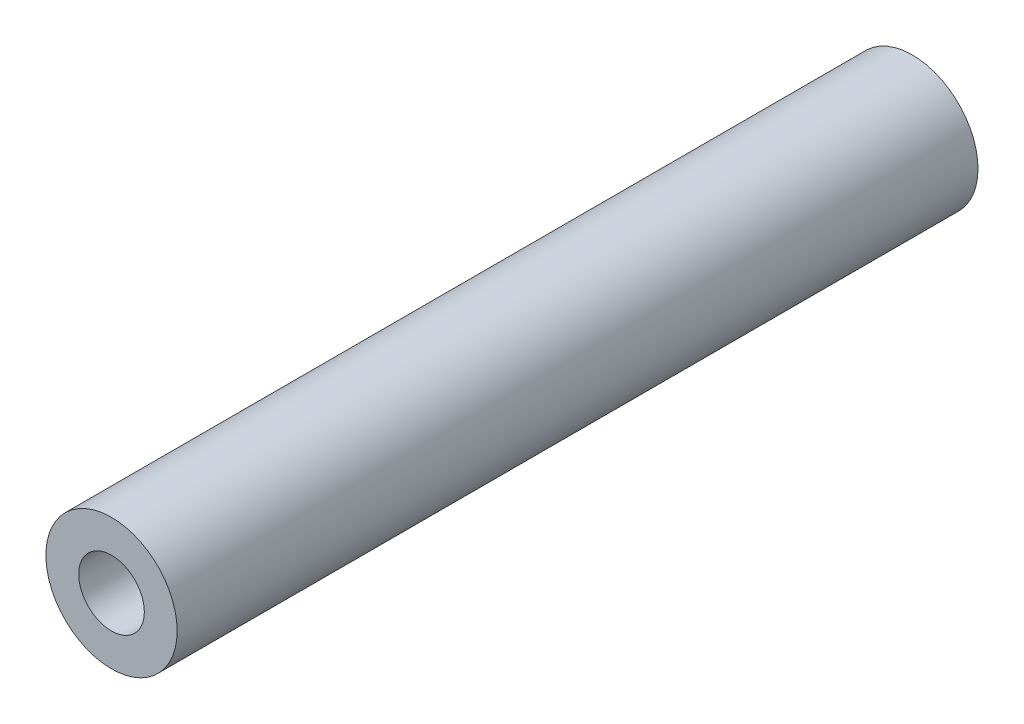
ISO-10303-21;
HEADER;
FILE_DESCRIPTION(('STEP AP214'),'2;1');
FILE_NAME('part.step','',(''),(''),'','','');
FILE_SCHEMA(('AUTOMOTIVE_DESIGN { 1 0 10303 214 1 1 1 1 }'));
ENDSEC;
DATA;
#1=APPLICATION_CONTEXT('core data for automotive mechanical design processes');
#2=APPLICATION_PROTOCOL_DEFINITION('international standard','automotive_design',2000,#1);
#3=PRODUCT_CONTEXT('',#1,'mechanical');
#4=PRODUCT('Part','Part','',(#3));
#5=PRODUCT_RELATED_PRODUCT_CATEGORY('part','',(#4));
#6=PRODUCT_DEFINITION_FORMATION('','',#4);
#7=PRODUCT_DEFINITION_CONTEXT('part definition',#1,'design');
#8=PRODUCT_DEFINITION('design','',#6,#7);
#9=PRODUCT_DEFINITION_SHAPE('','',#8);
#10=(LENGTH_UNIT() NAMED_UNIT(*) SI_UNIT(.MILLI.,.METRE.));
#11=(NAMED_UNIT(*) PLANE_ANGLE_UNIT() SI_UNIT($,.RADIAN.));
#12=(NAMED_UNIT(*) SI_UNIT($,.STERADIAN.) SOLID_ANGLE_UNIT());
#13=UNCERTAINTY_MEASURE_WITH_UNIT(LENGTH_MEASURE(1.E-05),#10,'distance_accuracy_value','');
#14=(GEOMETRIC_REPRESENTATION_CONTEXT(3) GLOBAL_UNCERTAINTY_ASSIGNED_CONTEXT((#13)) GLOBAL_UNIT_ASSIGNED_CONTEXT((#10,
#11,#12)) REPRESENTATION_CONTEXT('',''));
#15=CARTESIAN_POINT('',(0.,0.,0.));
#16=DIRECTION('',(0.,0.,1.));
#17=DIRECTION('',(1.,0.,0.));
#18=AXIS2_PLACEMENT_3D('',#15,#16,#17);
#19=CARTESIAN_POINT('',(0.,0.,305.));
#20=DIRECTION('',(0.,0.,1.));
#21=DIRECTION('',(1.,0.,0.));
#22=AXIS2_PLACEMENT_3D('',#19,#20,#21);
#23=PLANE('',#22);
#24=CARTESIAN_POINT('',(0.,0.,305.));
#25=DIRECTION('',(0.,0.,1.));
#26=DIRECTION('',(1.,0.,0.));
#27=AXIS2_PLACEMENT_3D('',#24,#25,#26);
#28=CIRCLE('',#27,25.);
#29=CARTESIAN_POINT('',(25.,0.,305.));
#30=VERTEX_POINT('',#29);
#31=EDGE_CURVE('E9',#30,#30,#28,.T.);
#32=ORIENTED_EDGE('',*,*,#31,.T.);
#33=EDGE_LOOP('',(#32));
#34=FACE_BOUND('',#33,.T.);
#35=CARTESIAN_POINT('',(0.,0.,305.));
#36=DIRECTION('',(0.,0.,1.));
#37=DIRECTION('',(1.,0.,0.));
#38=AXIS2_PLACEMENT_3D('',#35,#36,#37);
#39=CIRCLE('',#38,12.5);
#40=CARTESIAN_POINT('',(12.5,0.,305.));
#41=VERTEX_POINT('',#40);
#42=EDGE_CURVE('E25',#41,#41,#39,.T.);
#43=ORIENTED_EDGE('',*,*,#42,.F.);
#44=EDGE_LOOP('',(#43));
#45=FACE_BOUND('',#44,.T.);
#46=ADVANCED_FACE('F14',(#34,#45),#23,.T.);
#47=CARTESIAN_POINT('',(0.,0.,0.));
#48=DIRECTION('',(0.,0.,1.));
#49=DIRECTION('',(1.,0.,0.));
#50=AXIS2_PLACEMENT_3D('',#47,#48,#49);
#51=PLANE('',#50);
#52=CARTESIAN_POINT('',(0.,0.,0.));
#53=DIRECTION('',(0.,0.,1.));
#54=DIRECTION('',(1.,0.,0.));
#55=AXIS2_PLACEMENT_3D('',#52,#53,#54);
#56=CIRCLE('',#55,25.);
#57=CARTESIAN_POINT('',(25.,0.,0.));
#58=VERTEX_POINT('',#57);
#59=EDGE_CURVE('E18',#58,#58,#56,.T.);
#60=ORIENTED_EDGE('',*,*,#59,.F.);
#61=EDGE_LOOP('',(#60));
#62=FACE_BOUND('',#61,.T.);
#63=CARTESIAN_POINT('',(0.,0.,0.));
#64=DIRECTION('',(0.,0.,1.));
#65=DIRECTION('',(1.,0.,0.));
#66=AXIS2_PLACEMENT_3D('',#63,#64,#65);
#67=CIRCLE('',#66,12.5);
#68=CARTESIAN_POINT('',(12.5,0.,0.));
#69=VERTEX_POINT('',#68);
#70=EDGE_CURVE('E27',#69,#69,#67,.T.);
#71=ORIENTED_EDGE('',*,*,#70,.T.);
#72=EDGE_LOOP('',(#71));
#73=FACE_BOUND('',#72,.T.);
#74=ADVANCED_FACE('F37',(#62,#73),#51,.F.);
#75=CARTESIAN_POINT('',(0.,0.,305.));
#76=DIRECTION('',(0.,0.,-1.));
#77=DIRECTION('',(-1.,0.,0.));
#78=AXIS2_PLACEMENT_3D('',#75,#76,#77);
#79=CYLINDRICAL_SURFACE('',#78,25.);
#80=ORIENTED_EDGE('',*,*,#31,.F.);
#81=EDGE_LOOP('',(#80));
#82=FACE_BOUND('',#81,.T.);
#83=ORIENTED_EDGE('',*,*,#59,.T.);
#84=EDGE_LOOP('',(#83));
#85=FACE_BOUND('',#84,.T.);
#86=ADVANCED_FACE('F16',(#82,#85),#79,.T.);
#87=CARTESIAN_POINT('',(0.,0.,305.));
#88=DIRECTION('',(0.,0.,-1.));
#89=DIRECTION('',(-1.,0.,0.));
#90=AXIS2_PLACEMENT_3D('',#87,#88,#89);
#91=CYLINDRICAL_SURFACE('',#90,12.5);
#92=ORIENTED_EDGE('',*,*,#42,.T.);
#93=EDGE_LOOP('',(#92));
#94=FACE_BOUND('',#93,.T.);
#95=ORIENTED_EDGE('',*,*,#70,.F.);
#96=EDGE_LOOP('',(#95));
#97=FACE_BOUND('',#96,.T.);
#98=ADVANCED_FACE('F33',(#94,#97),#91,.F.);
#99=CLOSED_SHELL('',(#46,#74,#86,#98));
#100=MANIFOLD_SOLID_BREP('B1',#99);
#101=ADVANCED_BREP_SHAPE_REPRESENTATION('',(#18,#100),#14);
#102=SHAPE_DEFINITION_REPRESENTATION(#9,#101);
ENDSEC;
END-ISO-10303-21;
